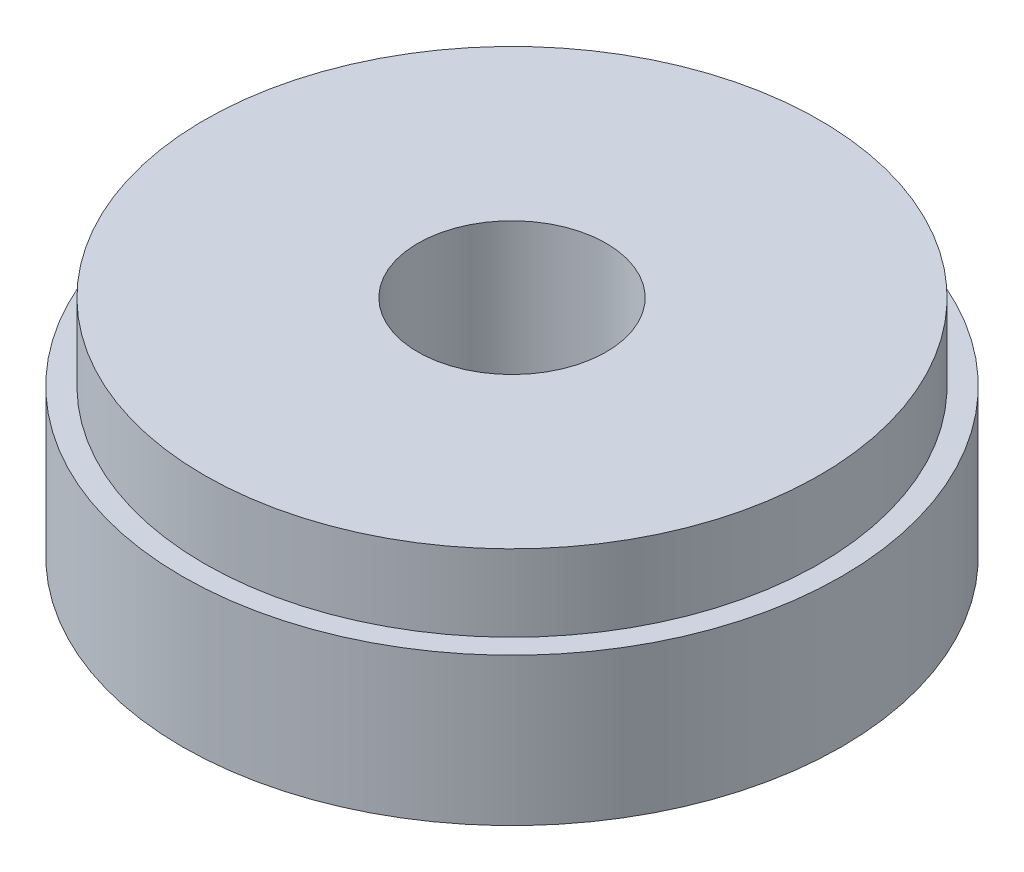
from build123d import *

# Parameters (mm, degrees)
SKETCH1_R                 = 21
EXTRUDE1_DEPTH            = 14.2748
SKETCH2_R                 = 14
EXTRUDE2_DEPTH            = 3
SKETCH3_R                 = 6
CUT_EXTRUDE1_DEPTH        = 35.357222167
CIRPATTERN1_COUNT         = 4
SKETCH6_OUTSIDE_W         = 56.372
SKETCH6_OUTSIDE_H         = 56.372
SKETCH6_OUTSIDE_R         = 19.5961
CUT_EXTRUDE2_DEPTH        = 4.8768
F_4_40_TAPPED_HOLE1_D     = 2.2606
F_4_40_TAPPED_HOLE1_DEPTH = 7.5946
F_4_40_TAPPED_HOLE1_TIP   = 0.679152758


with BuildPart() as part:
    # Sketch1 → Extrude1 (new body)
    with BuildSketch(Plane(origin=(0, 0, 0), x_dir=(1, 0, 0), z_dir=(0, 1, 0))):
        with Locations(Location((0, 0, 0), (0, 0, 270))):
            Circle(SKETCH1_R)
    extrude(amount=EXTRUDE1_DEPTH)

    # Sketch2 → Extrude2 (add)
    with BuildSketch(Plane.XZ):
        with Locations(Location((0, 0, 0), (0, 0, 90))):
            Circle(SKETCH2_R)
    extrude(amount=EXTRUDE2_DEPTH)

    # Sketch3 → Cut-Extrude1 (cut, through all)
    with BuildSketch(Plane.XZ.offset(3)):
        with Locations(Location((0, 0, 0), (0, 0, 270))):
            Circle(SKETCH3_R)
    extrude(amount=-CUT_EXTRUDE1_DEPTH, mode=Mode.SUBTRACT)

    # Sketch4 → M4x0.7 Tapped Hole1 (revolve, cut)
    with BuildSketch(Plane(origin=(17.5, 0, 0), x_dir=(0, 0, -1), z_dir=(1, 0, 0))):
        Polygon((0, 0), (0, 11.091420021), (1.65, 10.1), (1.65, 8), (2, 8), (2, 0), align=None)
    m4x0_7_tapped_hole1 = revolve(axis=Axis((17.5, -6.35, 0), (0, 1, 0)), mode=Mode.SUBTRACT)

    # CirPattern1: M4x0.7 Tapped Hole1 ×4 about axis
    cirpattern1_axis = Axis((0, 0, 0), (0, 1, 0))
    for i in range(1, CIRPATTERN1_COUNT):
        add(m4x0_7_tapped_hole1.rotate(cirpattern1_axis, i * 360 / CIRPATTERN1_COUNT), mode=Mode.SUBTRACT)

    # Sketch6 outside → Cut-Extrude2 (cut)
    with BuildSketch(Plane(origin=(0, 14.2748, 0), x_dir=(-1, 0, 0), z_dir=(0, 1, 0))):
        Rectangle(SKETCH6_OUTSIDE_W, SKETCH6_OUTSIDE_H)
        with Locations(Location((0, 0, 0), (0, 0, 90))):
            Circle(SKETCH6_OUTSIDE_R, mode=Mode.SUBTRACT)
    extrude(amount=-CUT_EXTRUDE2_DEPTH, mode=Mode.SUBTRACT)

    # 4-40 Tapped Hole1
    with Locations(Plane.XZ):
        with Locations((12.572358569, -12.572358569), (-12.572358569, -12.572358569), (-12.572358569, 12.572358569), (12.572358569, 12.572358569)):
            Hole(F_4_40_TAPPED_HOLE1_D / 2, depth=F_4_40_TAPPED_HOLE1_DEPTH)
            with Locations((0, 0, -(F_4_40_TAPPED_HOLE1_DEPTH + F_4_40_TAPPED_HOLE1_TIP / 2))):  # 118° drill point
                Cone(0, F_4_40_TAPPED_HOLE1_D / 2, F_4_40_TAPPED_HOLE1_TIP, mode=Mode.SUBTRACT)


solid = part.part
